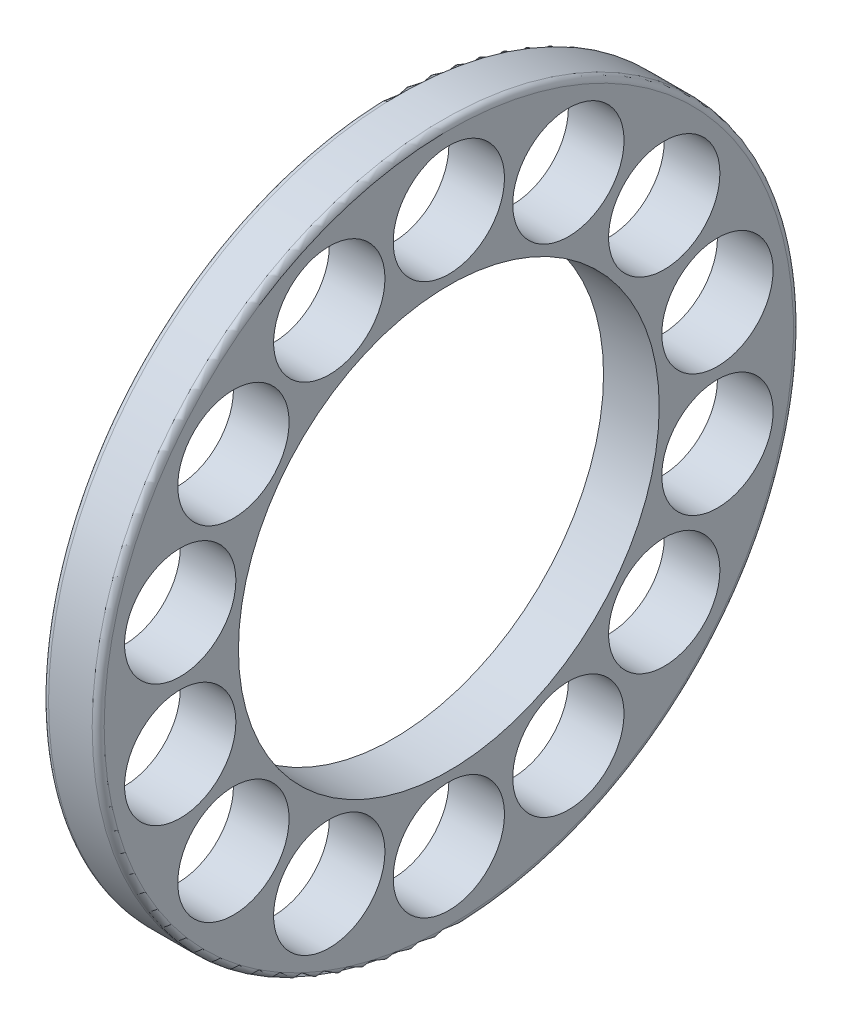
ISO-10303-21;
HEADER;
FILE_DESCRIPTION(('STEP AP214'),'2;1');
FILE_NAME('part.step','',(''),(''),'','','');
FILE_SCHEMA(('AUTOMOTIVE_DESIGN { 1 0 10303 214 1 1 1 1 }'));
ENDSEC;
DATA;
#1=APPLICATION_CONTEXT('core data for automotive mechanical design processes');
#2=APPLICATION_PROTOCOL_DEFINITION('international standard','automotive_design',2000,#1);
#3=PRODUCT_CONTEXT('',#1,'mechanical');
#4=PRODUCT('Part','Part','',(#3));
#5=PRODUCT_RELATED_PRODUCT_CATEGORY('part','',(#4));
#6=PRODUCT_DEFINITION_FORMATION('','',#4);
#7=PRODUCT_DEFINITION_CONTEXT('part definition',#1,'design');
#8=PRODUCT_DEFINITION('design','',#6,#7);
#9=PRODUCT_DEFINITION_SHAPE('','',#8);
#10=(LENGTH_UNIT() NAMED_UNIT(*) SI_UNIT(.MILLI.,.METRE.));
#11=(NAMED_UNIT(*) PLANE_ANGLE_UNIT() SI_UNIT($,.RADIAN.));
#12=(NAMED_UNIT(*) SI_UNIT($,.STERADIAN.) SOLID_ANGLE_UNIT());
#13=UNCERTAINTY_MEASURE_WITH_UNIT(LENGTH_MEASURE(1.E-05),#10,'distance_accuracy_value','');
#14=(GEOMETRIC_REPRESENTATION_CONTEXT(3) GLOBAL_UNCERTAINTY_ASSIGNED_CONTEXT((#13)) GLOBAL_UNIT_ASSIGNED_CONTEXT((#10,
#11,#12)) REPRESENTATION_CONTEXT('',''));
#15=CARTESIAN_POINT('',(0.,0.,0.));
#16=DIRECTION('',(0.,0.,1.));
#17=DIRECTION('',(1.,0.,0.));
#18=AXIS2_PLACEMENT_3D('',#15,#16,#17);
#19=CARTESIAN_POINT('',(3.611,-17.5195131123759,-17.2));
#20=DIRECTION('',(-1.,0.,0.));
#21=DIRECTION('',(0.,0.,1.));
#22=AXIS2_PLACEMENT_3D('',#19,#20,#21);
#23=PLANE('',#22);
#24=CARTESIAN_POINT('',(3.611,0.,0.));
#25=DIRECTION('',(-1.,0.,0.));
#26=DIRECTION('',(0.,0.,-1.));
#27=AXIS2_PLACEMENT_3D('',#24,#25,#26);
#28=CIRCLE('',#27,17.2000000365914);
#29=CARTESIAN_POINT('',(3.611,0.,-17.2000000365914));
#30=VERTEX_POINT('',#29);
#31=EDGE_CURVE('E122',#30,#30,#28,.F.);
#32=ORIENTED_EDGE('',*,*,#31,.F.);
#33=EDGE_LOOP('',(#32));
#34=FACE_BOUND('',#33,.T.);
#35=CARTESIAN_POINT('',(3.611,0.,0.));
#36=DIRECTION('',(1.,0.,0.));
#37=DIRECTION('',(0.,-1.16833933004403E-09,1.));
#38=AXIS2_PLACEMENT_3D('',#35,#36,#37);
#39=CIRCLE('',#38,10.5);
#40=CARTESIAN_POINT('',(3.611,-1.22675629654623E-08,10.5));
#41=VERTEX_POINT('',#40);
#42=EDGE_CURVE('E119',#41,#41,#39,.T.);
#43=ORIENTED_EDGE('',*,*,#42,.T.);
#44=EDGE_LOOP('',(#43));
#45=FACE_BOUND('',#44,.T.);
#46=CARTESIAN_POINT('',(3.611,-12.388321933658,-5.9659014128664));
#47=DIRECTION('',(1.,0.,0.));
#48=DIRECTION('',(0.,0.,1.));
#49=AXIS2_PLACEMENT_3D('',#46,#47,#48);
#50=CIRCLE('',#49,2.778);
#51=CARTESIAN_POINT('',(3.611,-12.388321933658,-3.1879014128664));
#52=VERTEX_POINT('',#51);
#53=EDGE_CURVE('E116',#52,#52,#50,.T.);
#54=ORIENTED_EDGE('',*,*,#53,.T.);
#55=EDGE_LOOP('',(#54));
#56=FACE_BOUND('',#55,.T.);
#57=CARTESIAN_POINT('',(3.611,-8.5729847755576,-10.750182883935));
#58=DIRECTION('',(1.,0.,0.));
#59=DIRECTION('',(0.,0.,1.));
#60=AXIS2_PLACEMENT_3D('',#57,#58,#59);
#61=CIRCLE('',#60,2.778);
#62=CARTESIAN_POINT('',(3.611,-8.5729847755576,-7.972182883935));
#63=VERTEX_POINT('',#62);
#64=EDGE_CURVE('E113',#63,#63,#61,.T.);
#65=ORIENTED_EDGE('',*,*,#64,.T.);
#66=EDGE_LOOP('',(#65));
#67=FACE_BOUND('',#66,.T.);
#68=CARTESIAN_POINT('',(3.611,-13.75,0.));
#69=DIRECTION('',(1.,0.,0.));
#70=DIRECTION('',(0.,0.,1.));
#71=AXIS2_PLACEMENT_3D('',#68,#69,#70);
#72=CIRCLE('',#71,2.778);
#73=CARTESIAN_POINT('',(3.611,-13.75,2.778));
#74=VERTEX_POINT('',#73);
#75=EDGE_CURVE('E110',#74,#74,#72,.T.);
#76=ORIENTED_EDGE('',*,*,#75,.T.);
#77=EDGE_LOOP('',(#76));
#78=FACE_BOUND('',#77,.T.);
#79=CARTESIAN_POINT('',(3.611,-12.388321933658,5.9659014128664));
#80=DIRECTION('',(1.,0.,0.));
#81=DIRECTION('',(0.,0.,1.));
#82=AXIS2_PLACEMENT_3D('',#79,#80,#81);
#83=CIRCLE('',#82,2.778);
#84=CARTESIAN_POINT('',(3.611,-12.388321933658,8.7439014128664));
#85=VERTEX_POINT('',#84);
#86=EDGE_CURVE('E107',#85,#85,#83,.T.);
#87=ORIENTED_EDGE('',*,*,#86,.T.);
#88=EDGE_LOOP('',(#87));
#89=FACE_BOUND('',#88,.T.);
#90=CARTESIAN_POINT('',(3.611,-3.0596628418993,13.4052587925));
#91=DIRECTION('',(1.,0.,0.));
#92=DIRECTION('',(0.,0.,1.));
#93=AXIS2_PLACEMENT_3D('',#90,#91,#92);
#94=CIRCLE('',#93,2.778);
#95=CARTESIAN_POINT('',(3.611,-3.0596628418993,16.1832587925));
#96=VERTEX_POINT('',#95);
#97=EDGE_CURVE('E104',#96,#96,#94,.T.);
#98=ORIENTED_EDGE('',*,*,#97,.T.);
#99=EDGE_LOOP('',(#98));
#100=FACE_BOUND('',#99,.T.);
#101=CARTESIAN_POINT('',(3.611,-8.5729847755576,10.750182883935));
#102=DIRECTION('',(1.,0.,0.));
#103=DIRECTION('',(0.,0.,1.));
#104=AXIS2_PLACEMENT_3D('',#101,#102,#103);
#105=CIRCLE('',#104,2.778);
#106=CARTESIAN_POINT('',(3.611,-8.5729847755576,13.528182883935));
#107=VERTEX_POINT('',#106);
#108=EDGE_CURVE('E101',#107,#107,#105,.T.);
#109=ORIENTED_EDGE('',*,*,#108,.T.);
#110=EDGE_LOOP('',(#109));
#111=FACE_BOUND('',#110,.T.);
#112=CARTESIAN_POINT('',(3.611,8.5729847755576,10.750182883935));
#113=DIRECTION('',(1.,0.,0.));
#114=DIRECTION('',(0.,0.,1.));
#115=AXIS2_PLACEMENT_3D('',#112,#113,#114);
#116=CIRCLE('',#115,2.778);
#117=CARTESIAN_POINT('',(3.611,8.57298477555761,13.528182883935));
#118=VERTEX_POINT('',#117);
#119=EDGE_CURVE('E98',#118,#118,#116,.T.);
#120=ORIENTED_EDGE('',*,*,#119,.T.);
#121=EDGE_LOOP('',(#120));
#122=FACE_BOUND('',#121,.T.);
#123=CARTESIAN_POINT('',(3.611,3.0596628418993,13.4052587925));
#124=DIRECTION('',(1.,0.,0.));
#125=DIRECTION('',(0.,0.,1.));
#126=AXIS2_PLACEMENT_3D('',#123,#124,#125);
#127=CIRCLE('',#126,2.778);
#128=CARTESIAN_POINT('',(3.611,3.0596628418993,16.1832587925));
#129=VERTEX_POINT('',#128);
#130=EDGE_CURVE('E95',#129,#129,#127,.T.);
#131=ORIENTED_EDGE('',*,*,#130,.T.);
#132=EDGE_LOOP('',(#131));
#133=FACE_BOUND('',#132,.T.);
#134=CARTESIAN_POINT('',(3.611,8.5729847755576,-10.750182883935));
#135=DIRECTION('',(1.,0.,0.));
#136=DIRECTION('',(0.,0.,1.));
#137=AXIS2_PLACEMENT_3D('',#134,#135,#136);
#138=CIRCLE('',#137,2.778);
#139=CARTESIAN_POINT('',(3.611,8.57298477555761,-7.972182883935));
#140=VERTEX_POINT('',#139);
#141=EDGE_CURVE('E92',#140,#140,#138,.T.);
#142=ORIENTED_EDGE('',*,*,#141,.T.);
#143=EDGE_LOOP('',(#142));
#144=FACE_BOUND('',#143,.T.);
#145=CARTESIAN_POINT('',(3.611,12.388321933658,-5.9659014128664));
#146=DIRECTION('',(1.,0.,0.));
#147=DIRECTION('',(0.,0.,1.));
#148=AXIS2_PLACEMENT_3D('',#145,#146,#147);
#149=CIRCLE('',#148,2.778);
#150=CARTESIAN_POINT('',(3.611,12.388321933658,-3.1879014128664));
#151=VERTEX_POINT('',#150);
#152=EDGE_CURVE('E89',#151,#151,#149,.T.);
#153=ORIENTED_EDGE('',*,*,#152,.T.);
#154=EDGE_LOOP('',(#153));
#155=FACE_BOUND('',#154,.T.);
#156=CARTESIAN_POINT('',(3.611,3.0596628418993,-13.4052587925));
#157=DIRECTION('',(1.,0.,0.));
#158=DIRECTION('',(0.,0.,1.));
#159=AXIS2_PLACEMENT_3D('',#156,#157,#158);
#160=CIRCLE('',#159,2.778);
#161=CARTESIAN_POINT('',(3.611,3.0596628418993,-10.6272587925));
#162=VERTEX_POINT('',#161);
#163=EDGE_CURVE('E86',#162,#162,#160,.T.);
#164=ORIENTED_EDGE('',*,*,#163,.T.);
#165=EDGE_LOOP('',(#164));
#166=FACE_BOUND('',#165,.T.);
#167=CARTESIAN_POINT('',(3.611,-3.0596628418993,-13.4052587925));
#168=DIRECTION('',(1.,0.,0.));
#169=DIRECTION('',(0.,0.,1.));
#170=AXIS2_PLACEMENT_3D('',#167,#168,#169);
#171=CIRCLE('',#170,2.778);
#172=CARTESIAN_POINT('',(3.611,-3.0596628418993,-10.6272587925));
#173=VERTEX_POINT('',#172);
#174=EDGE_CURVE('E83',#173,#173,#171,.T.);
#175=ORIENTED_EDGE('',*,*,#174,.T.);
#176=EDGE_LOOP('',(#175));
#177=FACE_BOUND('',#176,.T.);
#178=CARTESIAN_POINT('',(3.611,12.388321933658,5.9659014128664));
#179=DIRECTION('',(1.,0.,0.));
#180=DIRECTION('',(0.,0.,1.));
#181=AXIS2_PLACEMENT_3D('',#178,#179,#180);
#182=CIRCLE('',#181,2.778);
#183=CARTESIAN_POINT('',(3.611,12.388321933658,8.7439014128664));
#184=VERTEX_POINT('',#183);
#185=EDGE_CURVE('E80',#184,#184,#182,.T.);
#186=ORIENTED_EDGE('',*,*,#185,.T.);
#187=EDGE_LOOP('',(#186));
#188=FACE_BOUND('',#187,.T.);
#189=CARTESIAN_POINT('',(3.611,13.75,0.));
#190=DIRECTION('',(1.,0.,0.));
#191=DIRECTION('',(0.,0.,1.));
#192=AXIS2_PLACEMENT_3D('',#189,#190,#191);
#193=CIRCLE('',#192,2.778);
#194=CARTESIAN_POINT('',(3.611,13.75,2.778));
#195=VERTEX_POINT('',#194);
#196=EDGE_CURVE('E77',#195,#195,#193,.T.);
#197=ORIENTED_EDGE('',*,*,#196,.T.);
#198=EDGE_LOOP('',(#197));
#199=FACE_BOUND('',#198,.T.);
#200=ADVANCED_FACE('F15',(#34,#45,#56,#67,#78,#89,#100,#111,#122,#133,#144,#155,#166,#177,#188,
#199),#23,.T.);
#201=CARTESIAN_POINT('',(6.389,-17.5195131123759,17.2));
#202=DIRECTION('',(1.,0.,0.));
#203=DIRECTION('',(0.,0.,-1.));
#204=AXIS2_PLACEMENT_3D('',#201,#202,#203);
#205=PLANE('',#204);
#206=CARTESIAN_POINT('',(6.389,0.,0.));
#207=DIRECTION('',(1.,0.,0.));
#208=DIRECTION('',(0.,0.,1.));
#209=AXIS2_PLACEMENT_3D('',#206,#207,#208);
#210=CIRCLE('',#209,17.2);
#211=CARTESIAN_POINT('',(6.389,0.,17.2));
#212=VERTEX_POINT('',#211);
#213=EDGE_CURVE('E74',#212,#212,#210,.T.);
#214=ORIENTED_EDGE('',*,*,#213,.T.);
#215=EDGE_LOOP('',(#214));
#216=FACE_BOUND('',#215,.T.);
#217=CARTESIAN_POINT('',(6.389,0.,0.));
#218=DIRECTION('',(-1.,0.,0.));
#219=DIRECTION('',(0.,0.,-1.));
#220=AXIS2_PLACEMENT_3D('',#217,#218,#219);
#221=CIRCLE('',#220,10.5);
#222=CARTESIAN_POINT('',(6.389,0.,-10.5));
#223=VERTEX_POINT('',#222);
#224=EDGE_CURVE('E71',#223,#223,#221,.F.);
#225=ORIENTED_EDGE('',*,*,#224,.F.);
#226=EDGE_LOOP('',(#225));
#227=FACE_BOUND('',#226,.T.);
#228=CARTESIAN_POINT('',(6.389,-12.388321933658,-5.9659014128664));
#229=DIRECTION('',(-1.,0.,0.));
#230=DIRECTION('',(0.,0.,-1.));
#231=AXIS2_PLACEMENT_3D('',#228,#229,#230);
#232=CIRCLE('',#231,2.778);
#233=CARTESIAN_POINT('',(6.389,-12.388321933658,-8.7439014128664));
#234=VERTEX_POINT('',#233);
#235=EDGE_CURVE('E68',#234,#234,#232,.T.);
#236=ORIENTED_EDGE('',*,*,#235,.T.);
#237=EDGE_LOOP('',(#236));
#238=FACE_BOUND('',#237,.T.);
#239=CARTESIAN_POINT('',(6.389,-8.5729847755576,-10.750182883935));
#240=DIRECTION('',(-1.,0.,0.));
#241=DIRECTION('',(0.,0.,-1.));
#242=AXIS2_PLACEMENT_3D('',#239,#240,#241);
#243=CIRCLE('',#242,2.778);
#244=CARTESIAN_POINT('',(6.389,-8.5729847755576,-13.528182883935));
#245=VERTEX_POINT('',#244);
#246=EDGE_CURVE('E65',#245,#245,#243,.T.);
#247=ORIENTED_EDGE('',*,*,#246,.T.);
#248=EDGE_LOOP('',(#247));
#249=FACE_BOUND('',#248,.T.);
#250=CARTESIAN_POINT('',(6.389,-13.75,0.));
#251=DIRECTION('',(-1.,0.,0.));
#252=DIRECTION('',(0.,-1.42053901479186E-07,-0.99999999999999));
#253=AXIS2_PLACEMENT_3D('',#250,#251,#252);
#254=CIRCLE('',#253,2.778);
#255=CARTESIAN_POINT('',(6.389,-13.7500003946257,-2.77799999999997));
#256=VERTEX_POINT('',#255);
#257=EDGE_CURVE('E62',#256,#256,#254,.T.);
#258=ORIENTED_EDGE('',*,*,#257,.T.);
#259=EDGE_LOOP('',(#258));
#260=FACE_BOUND('',#259,.T.);
#261=CARTESIAN_POINT('',(6.389,-12.388321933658,5.9659014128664));
#262=DIRECTION('',(-1.,0.,0.));
#263=DIRECTION('',(0.,0.,-1.));
#264=AXIS2_PLACEMENT_3D('',#261,#262,#263);
#265=CIRCLE('',#264,2.778);
#266=CARTESIAN_POINT('',(6.389,-12.388321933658,3.1879014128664));
#267=VERTEX_POINT('',#266);
#268=EDGE_CURVE('E59',#267,#267,#265,.T.);
#269=ORIENTED_EDGE('',*,*,#268,.T.);
#270=EDGE_LOOP('',(#269));
#271=FACE_BOUND('',#270,.T.);
#272=CARTESIAN_POINT('',(6.389,-3.0596628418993,13.4052587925));
#273=DIRECTION('',(-1.,0.,0.));
#274=DIRECTION('',(0.,0.,-1.));
#275=AXIS2_PLACEMENT_3D('',#272,#273,#274);
#276=CIRCLE('',#275,2.778);
#277=CARTESIAN_POINT('',(6.389,-3.0596628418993,10.6272587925));
#278=VERTEX_POINT('',#277);
#279=EDGE_CURVE('E56',#278,#278,#276,.T.);
#280=ORIENTED_EDGE('',*,*,#279,.T.);
#281=EDGE_LOOP('',(#280));
#282=FACE_BOUND('',#281,.T.);
#283=CARTESIAN_POINT('',(6.389,-8.5729847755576,10.750182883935));
#284=DIRECTION('',(-1.,0.,0.));
#285=DIRECTION('',(0.,0.,-1.));
#286=AXIS2_PLACEMENT_3D('',#283,#284,#285);
#287=CIRCLE('',#286,2.778);
#288=CARTESIAN_POINT('',(6.389,-8.5729847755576,7.972182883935));
#289=VERTEX_POINT('',#288);
#290=EDGE_CURVE('E53',#289,#289,#287,.T.);
#291=ORIENTED_EDGE('',*,*,#290,.T.);
#292=EDGE_LOOP('',(#291));
#293=FACE_BOUND('',#292,.T.);
#294=CARTESIAN_POINT('',(6.389,8.5729847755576,10.750182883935));
#295=DIRECTION('',(-1.,0.,0.));
#296=DIRECTION('',(0.,0.,-1.));
#297=AXIS2_PLACEMENT_3D('',#294,#295,#296);
#298=CIRCLE('',#297,2.778);
#299=CARTESIAN_POINT('',(6.389,8.57298477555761,7.972182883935));
#300=VERTEX_POINT('',#299);
#301=EDGE_CURVE('E50',#300,#300,#298,.T.);
#302=ORIENTED_EDGE('',*,*,#301,.T.);
#303=EDGE_LOOP('',(#302));
#304=FACE_BOUND('',#303,.T.);
#305=CARTESIAN_POINT('',(6.389,3.0596628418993,13.4052587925));
#306=DIRECTION('',(-1.,0.,0.));
#307=DIRECTION('',(0.,0.,-1.));
#308=AXIS2_PLACEMENT_3D('',#305,#306,#307);
#309=CIRCLE('',#308,2.778);
#310=CARTESIAN_POINT('',(6.389,3.0596628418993,10.6272587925));
#311=VERTEX_POINT('',#310);
#312=EDGE_CURVE('E47',#311,#311,#309,.T.);
#313=ORIENTED_EDGE('',*,*,#312,.T.);
#314=EDGE_LOOP('',(#313));
#315=FACE_BOUND('',#314,.T.);
#316=CARTESIAN_POINT('',(6.389,8.5729847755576,-10.750182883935));
#317=DIRECTION('',(-1.,0.,0.));
#318=DIRECTION('',(0.,0.,-1.));
#319=AXIS2_PLACEMENT_3D('',#316,#317,#318);
#320=CIRCLE('',#319,2.778);
#321=CARTESIAN_POINT('',(6.389,8.57298477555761,-13.528182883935));
#322=VERTEX_POINT('',#321);
#323=EDGE_CURVE('E44',#322,#322,#320,.T.);
#324=ORIENTED_EDGE('',*,*,#323,.T.);
#325=EDGE_LOOP('',(#324));
#326=FACE_BOUND('',#325,.T.);
#327=CARTESIAN_POINT('',(6.389,12.388321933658,-5.9659014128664));
#328=DIRECTION('',(-1.,0.,0.));
#329=DIRECTION('',(0.,0.,-1.));
#330=AXIS2_PLACEMENT_3D('',#327,#328,#329);
#331=CIRCLE('',#330,2.778);
#332=CARTESIAN_POINT('',(6.389,12.388321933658,-8.7439014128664));
#333=VERTEX_POINT('',#332);
#334=EDGE_CURVE('E41',#333,#333,#331,.T.);
#335=ORIENTED_EDGE('',*,*,#334,.T.);
#336=EDGE_LOOP('',(#335));
#337=FACE_BOUND('',#336,.T.);
#338=CARTESIAN_POINT('',(6.389,3.0596628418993,-13.4052587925));
#339=DIRECTION('',(-1.,0.,0.));
#340=DIRECTION('',(0.,0.,-1.));
#341=AXIS2_PLACEMENT_3D('',#338,#339,#340);
#342=CIRCLE('',#341,2.778);
#343=CARTESIAN_POINT('',(6.389,3.0596628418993,-16.1832587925));
#344=VERTEX_POINT('',#343);
#345=EDGE_CURVE('E38',#344,#344,#342,.T.);
#346=ORIENTED_EDGE('',*,*,#345,.T.);
#347=EDGE_LOOP('',(#346));
#348=FACE_BOUND('',#347,.T.);
#349=CARTESIAN_POINT('',(6.389,-3.0596628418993,-13.4052587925));
#350=DIRECTION('',(-1.,0.,0.));
#351=DIRECTION('',(0.,0.,-1.));
#352=AXIS2_PLACEMENT_3D('',#349,#350,#351);
#353=CIRCLE('',#352,2.778);
#354=CARTESIAN_POINT('',(6.389,-3.0596628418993,-16.1832587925));
#355=VERTEX_POINT('',#354);
#356=EDGE_CURVE('E35',#355,#355,#353,.T.);
#357=ORIENTED_EDGE('',*,*,#356,.T.);
#358=EDGE_LOOP('',(#357));
#359=FACE_BOUND('',#358,.T.);
#360=CARTESIAN_POINT('',(6.389,12.388321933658,5.9659014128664));
#361=DIRECTION('',(-1.,0.,0.));
#362=DIRECTION('',(0.,0.,-1.));
#363=AXIS2_PLACEMENT_3D('',#360,#361,#362);
#364=CIRCLE('',#363,2.778);
#365=CARTESIAN_POINT('',(6.389,12.388321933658,3.1879014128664));
#366=VERTEX_POINT('',#365);
#367=EDGE_CURVE('E30',#366,#366,#364,.T.);
#368=ORIENTED_EDGE('',*,*,#367,.T.);
#369=EDGE_LOOP('',(#368));
#370=FACE_BOUND('',#369,.T.);
#371=CARTESIAN_POINT('',(6.389,13.75,0.));
#372=DIRECTION('',(-1.,0.,0.));
#373=DIRECTION('',(0.,-1.42053900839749E-07,-0.99999999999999));
#374=AXIS2_PLACEMENT_3D('',#371,#372,#373);
#375=CIRCLE('',#374,2.778);
#376=CARTESIAN_POINT('',(6.389,13.7499996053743,-2.77799999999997));
#377=VERTEX_POINT('',#376);
#378=EDGE_CURVE('E26',#377,#377,#375,.T.);
#379=ORIENTED_EDGE('',*,*,#378,.T.);
#380=EDGE_LOOP('',(#379));
#381=FACE_BOUND('',#380,.T.);
#382=ADVANCED_FACE('F131',(#216,#227,#238,#249,#260,#271,#282,#293,#304,#315,#326,#337,#348,
#359,#370,#381),#205,.T.);
#383=CARTESIAN_POINT('',(3.91099999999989,0.,0.));
#384=DIRECTION('',(1.,0.,0.));
#385=DIRECTION('',(0.,1.92338267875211E-10,1.));
#386=AXIS2_PLACEMENT_3D('',#383,#384,#385);
#387=TOROIDAL_SURFACE('',#386,17.2,0.299999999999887);
#388=ORIENTED_EDGE('',*,*,#31,.T.);
#389=EDGE_LOOP('',(#388));
#390=FACE_BOUND('',#389,.T.);
#391=CARTESIAN_POINT('',(3.91099999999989,0.,0.));
#392=DIRECTION('',(-1.,0.,0.));
#393=DIRECTION('',(0.,0.,-1.));
#394=AXIS2_PLACEMENT_3D('',#391,#392,#393);
#395=CIRCLE('',#394,17.4999999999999);
#396=CARTESIAN_POINT('',(3.91099999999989,0.,-17.4999999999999));
#397=VERTEX_POINT('',#396);
#398=EDGE_CURVE('E22',#397,#397,#395,.F.);
#399=ORIENTED_EDGE('',*,*,#398,.F.);
#400=EDGE_LOOP('',(#399));
#401=FACE_BOUND('',#400,.T.);
#402=ADVANCED_FACE('F126',(#390,#401),#387,.T.);
#403=CARTESIAN_POINT('',(6.389,0.,0.));
#404=DIRECTION('',(1.,0.,0.));
#405=DIRECTION('',(0.,0.,1.));
#406=AXIS2_PLACEMENT_3D('',#403,#404,#405);
#407=CYLINDRICAL_SURFACE('',#406,10.5);
#408=ORIENTED_EDGE('',*,*,#224,.T.);
#409=EDGE_LOOP('',(#408));
#410=FACE_BOUND('',#409,.T.);
#411=ORIENTED_EDGE('',*,*,#42,.F.);
#412=EDGE_LOOP('',(#411));
#413=FACE_BOUND('',#412,.T.);
#414=ADVANCED_FACE('F178',(#410,#413),#407,.F.);
#415=CARTESIAN_POINT('',(6.08900000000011,0.,0.));
#416=DIRECTION('',(1.,0.,0.));
#417=DIRECTION('',(0.,0.,1.));
#418=AXIS2_PLACEMENT_3D('',#415,#416,#417);
#419=TOROIDAL_SURFACE('',#418,17.2,0.299999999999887);
#420=CARTESIAN_POINT('',(6.08900000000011,0.,0.));
#421=DIRECTION('',(1.,0.,0.));
#422=DIRECTION('',(0.,0.,1.));
#423=AXIS2_PLACEMENT_3D('',#420,#421,#422);
#424=CIRCLE('',#423,17.4999999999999);
#425=CARTESIAN_POINT('',(6.08900000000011,0.,17.4999999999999));
#426=VERTEX_POINT('',#425);
#427=EDGE_CURVE('E10',#426,#426,#424,.T.);
#428=ORIENTED_EDGE('',*,*,#427,.T.);
#429=EDGE_LOOP('',(#428));
#430=FACE_BOUND('',#429,.T.);
#431=ORIENTED_EDGE('',*,*,#213,.F.);
#432=EDGE_LOOP('',(#431));
#433=FACE_BOUND('',#432,.T.);
#434=ADVANCED_FACE('F184',(#430,#433),#419,.T.);
#435=CARTESIAN_POINT('',(6.389,0.,0.));
#436=DIRECTION('',(1.,0.,0.));
#437=DIRECTION('',(0.,1.92338267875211E-10,1.));
#438=AXIS2_PLACEMENT_3D('',#435,#436,#437);
#439=CYLINDRICAL_SURFACE('',#438,17.5);
#440=ORIENTED_EDGE('',*,*,#398,.T.);
#441=EDGE_LOOP('',(#440));
#442=FACE_BOUND('',#441,.T.);
#443=ORIENTED_EDGE('',*,*,#427,.F.);
#444=EDGE_LOOP('',(#443));
#445=FACE_BOUND('',#444,.T.);
#446=ADVANCED_FACE('F167',(#442,#445),#439,.T.);
#447=CARTESIAN_POINT('',(10.,13.75,0.));
#448=DIRECTION('',(-1.,0.,0.));
#449=DIRECTION('',(0.,0.,-1.));
#450=AXIS2_PLACEMENT_3D('',#447,#448,#449);
#451=CYLINDRICAL_SURFACE('',#450,2.778);
#452=ORIENTED_EDGE('',*,*,#196,.F.);
#453=EDGE_LOOP('',(#452));
#454=FACE_BOUND('',#453,.T.);
#455=ORIENTED_EDGE('',*,*,#378,.F.);
#456=EDGE_LOOP('',(#455));
#457=FACE_BOUND('',#456,.T.);
#458=ADVANCED_FACE('F163',(#454,#457),#451,.F.);
#459=CARTESIAN_POINT('',(10.,12.388321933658,5.9659014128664));
#460=DIRECTION('',(-1.,0.,0.));
#461=DIRECTION('',(0.,1.42053867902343E-07,-0.99999999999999));
#462=AXIS2_PLACEMENT_3D('',#459,#460,#461);
#463=CYLINDRICAL_SURFACE('',#462,2.778);
#464=ORIENTED_EDGE('',*,*,#185,.F.);
#465=EDGE_LOOP('',(#464));
#466=FACE_BOUND('',#465,.T.);
#467=ORIENTED_EDGE('',*,*,#367,.F.);
#468=EDGE_LOOP('',(#467));
#469=FACE_BOUND('',#468,.T.);
#470=ADVANCED_FACE('F166',(#466,#469),#463,.F.);
#471=CARTESIAN_POINT('',(10.,-3.0596628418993,-13.4052587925));
#472=DIRECTION('',(-1.,0.,0.));
#473=DIRECTION('',(0.,1.42053902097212E-07,-0.99999999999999));
#474=AXIS2_PLACEMENT_3D('',#471,#472,#473);
#475=CYLINDRICAL_SURFACE('',#474,2.778);
#476=ORIENTED_EDGE('',*,*,#174,.F.);
#477=EDGE_LOOP('',(#476));
#478=FACE_BOUND('',#477,.T.);
#479=ORIENTED_EDGE('',*,*,#356,.F.);
#480=EDGE_LOOP('',(#479));
#481=FACE_BOUND('',#480,.T.);
#482=ADVANCED_FACE('F192',(#478,#481),#475,.F.);
#483=CARTESIAN_POINT('',(10.,3.0596628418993,-13.4052587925));
#484=DIRECTION('',(-1.,0.,0.));
#485=DIRECTION('',(0.,1.42053901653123E-07,-0.99999999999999));
#486=AXIS2_PLACEMENT_3D('',#483,#484,#485);
#487=CYLINDRICAL_SURFACE('',#486,2.778);
#488=ORIENTED_EDGE('',*,*,#163,.F.);
#489=EDGE_LOOP('',(#488));
#490=FACE_BOUND('',#489,.T.);
#491=ORIENTED_EDGE('',*,*,#345,.F.);
#492=EDGE_LOOP('',(#491));
#493=FACE_BOUND('',#492,.T.);
#494=ADVANCED_FACE('F196',(#490,#493),#487,.F.);
#495=CARTESIAN_POINT('',(10.,12.388321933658,-5.9659014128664));
#496=DIRECTION('',(-1.,0.,0.));
#497=DIRECTION('',(0.,1.42053901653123E-07,-0.99999999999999));
#498=AXIS2_PLACEMENT_3D('',#495,#496,#497);
#499=CYLINDRICAL_SURFACE('',#498,2.778);
#500=ORIENTED_EDGE('',*,*,#152,.F.);
#501=EDGE_LOOP('',(#500));
#502=FACE_BOUND('',#501,.T.);
#503=ORIENTED_EDGE('',*,*,#334,.F.);
#504=EDGE_LOOP('',(#503));
#505=FACE_BOUND('',#504,.T.);
#506=ADVANCED_FACE('F200',(#502,#505),#499,.F.);
#507=CARTESIAN_POINT('',(10.,8.5729847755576,-10.750182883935));
#508=DIRECTION('',(-1.,0.,0.));
#509=DIRECTION('',(0.,1.4205390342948E-07,-0.99999999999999));
#510=AXIS2_PLACEMENT_3D('',#507,#508,#509);
#511=CYLINDRICAL_SURFACE('',#510,2.778);
#512=ORIENTED_EDGE('',*,*,#141,.F.);
#513=EDGE_LOOP('',(#512));
#514=FACE_BOUND('',#513,.T.);
#515=ORIENTED_EDGE('',*,*,#323,.F.);
#516=EDGE_LOOP('',(#515));
#517=FACE_BOUND('',#516,.T.);
#518=ADVANCED_FACE('F204',(#514,#517),#511,.F.);
#519=CARTESIAN_POINT('',(10.,3.0596628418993,13.4052587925));
#520=DIRECTION('',(-1.,0.,0.));
#521=DIRECTION('',(0.,1.42053901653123E-07,-0.99999999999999));
#522=AXIS2_PLACEMENT_3D('',#519,#520,#521);
#523=CYLINDRICAL_SURFACE('',#522,2.778);
#524=ORIENTED_EDGE('',*,*,#130,.F.);
#525=EDGE_LOOP('',(#524));
#526=FACE_BOUND('',#525,.T.);
#527=ORIENTED_EDGE('',*,*,#312,.F.);
#528=EDGE_LOOP('',(#527));
#529=FACE_BOUND('',#528,.T.);
#530=ADVANCED_FACE('F208',(#526,#529),#523,.F.);
#531=CARTESIAN_POINT('',(10.,8.5729847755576,10.750182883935));
#532=DIRECTION('',(-1.,0.,0.));
#533=DIRECTION('',(0.,1.4205390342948E-07,-0.99999999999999));
#534=AXIS2_PLACEMENT_3D('',#531,#532,#533);
#535=CYLINDRICAL_SURFACE('',#534,2.778);
#536=ORIENTED_EDGE('',*,*,#119,.F.);
#537=EDGE_LOOP('',(#536));
#538=FACE_BOUND('',#537,.T.);
#539=ORIENTED_EDGE('',*,*,#301,.F.);
#540=EDGE_LOOP('',(#539));
#541=FACE_BOUND('',#540,.T.);
#542=ADVANCED_FACE('F212',(#538,#541),#535,.F.);
#543=CARTESIAN_POINT('',(10.,-8.5729847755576,10.750182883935));
#544=DIRECTION('',(-1.,0.,0.));
#545=DIRECTION('',(0.,1.4205390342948E-07,-0.99999999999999));
#546=AXIS2_PLACEMENT_3D('',#543,#544,#545);
#547=CYLINDRICAL_SURFACE('',#546,2.778);
#548=ORIENTED_EDGE('',*,*,#108,.F.);
#549=EDGE_LOOP('',(#548));
#550=FACE_BOUND('',#549,.T.);
#551=ORIENTED_EDGE('',*,*,#290,.F.);
#552=EDGE_LOOP('',(#551));
#553=FACE_BOUND('',#552,.T.);
#554=ADVANCED_FACE('F216',(#550,#553),#547,.F.);
#555=CARTESIAN_POINT('',(10.,-3.0596628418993,13.4052587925));
#556=DIRECTION('',(-1.,0.,0.));
#557=DIRECTION('',(0.,1.42053902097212E-07,-0.99999999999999));
#558=AXIS2_PLACEMENT_3D('',#555,#556,#557);
#559=CYLINDRICAL_SURFACE('',#558,2.778);
#560=ORIENTED_EDGE('',*,*,#97,.F.);
#561=EDGE_LOOP('',(#560));
#562=FACE_BOUND('',#561,.T.);
#563=ORIENTED_EDGE('',*,*,#279,.F.);
#564=EDGE_LOOP('',(#563));
#565=FACE_BOUND('',#564,.T.);
#566=ADVANCED_FACE('F220',(#562,#565),#559,.F.);
#567=CARTESIAN_POINT('',(10.,-12.388321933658,5.9659014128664));
#568=DIRECTION('',(-1.,0.,0.));
#569=DIRECTION('',(0.,1.42053901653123E-07,-0.99999999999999));
#570=AXIS2_PLACEMENT_3D('',#567,#568,#569);
#571=CYLINDRICAL_SURFACE('',#570,2.778);
#572=ORIENTED_EDGE('',*,*,#86,.F.);
#573=EDGE_LOOP('',(#572));
#574=FACE_BOUND('',#573,.T.);
#575=ORIENTED_EDGE('',*,*,#268,.F.);
#576=EDGE_LOOP('',(#575));
#577=FACE_BOUND('',#576,.T.);
#578=ADVANCED_FACE('F224',(#574,#577),#571,.F.);
#579=CARTESIAN_POINT('',(10.,-13.75,0.));
#580=DIRECTION('',(-1.,0.,0.));
#581=DIRECTION('',(0.,0.,-1.));
#582=AXIS2_PLACEMENT_3D('',#579,#580,#581);
#583=CYLINDRICAL_SURFACE('',#582,2.778);
#584=ORIENTED_EDGE('',*,*,#75,.F.);
#585=EDGE_LOOP('',(#584));
#586=FACE_BOUND('',#585,.T.);
#587=ORIENTED_EDGE('',*,*,#257,.F.);
#588=EDGE_LOOP('',(#587));
#589=FACE_BOUND('',#588,.T.);
#590=ADVANCED_FACE('F228',(#586,#589),#583,.F.);
#591=CARTESIAN_POINT('',(10.,-8.5729847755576,-10.750182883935));
#592=DIRECTION('',(-1.,0.,0.));
#593=DIRECTION('',(0.,1.4205390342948E-07,-0.99999999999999));
#594=AXIS2_PLACEMENT_3D('',#591,#592,#593);
#595=CYLINDRICAL_SURFACE('',#594,2.778);
#596=ORIENTED_EDGE('',*,*,#64,.F.);
#597=EDGE_LOOP('',(#596));
#598=FACE_BOUND('',#597,.T.);
#599=ORIENTED_EDGE('',*,*,#246,.F.);
#600=EDGE_LOOP('',(#599));
#601=FACE_BOUND('',#600,.T.);
#602=ADVANCED_FACE('F231',(#598,#601),#595,.F.);
#603=CARTESIAN_POINT('',(10.,-12.388321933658,-5.9659014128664));
#604=DIRECTION('',(-1.,0.,0.));
#605=DIRECTION('',(0.,1.42053901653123E-07,-0.99999999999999));
#606=AXIS2_PLACEMENT_3D('',#603,#604,#605);
#607=CYLINDRICAL_SURFACE('',#606,2.778);
#608=ORIENTED_EDGE('',*,*,#53,.F.);
#609=EDGE_LOOP('',(#608));
#610=FACE_BOUND('',#609,.T.);
#611=ORIENTED_EDGE('',*,*,#235,.F.);
#612=EDGE_LOOP('',(#611));
#613=FACE_BOUND('',#612,.T.);
#614=ADVANCED_FACE('F17',(#610,#613),#607,.F.);
#615=CLOSED_SHELL('',(#200,#382,#402,#414,#434,#446,#458,#470,#482,#494,#506,#518,#530,#542,
#554,#566,#578,#590,#602,#614));
#616=MANIFOLD_SOLID_BREP('B1',#615);
#617=ADVANCED_BREP_SHAPE_REPRESENTATION('',(#18,#616),#14);
#618=SHAPE_DEFINITION_REPRESENTATION(#9,#617);
ENDSEC;
END-ISO-10303-21;
